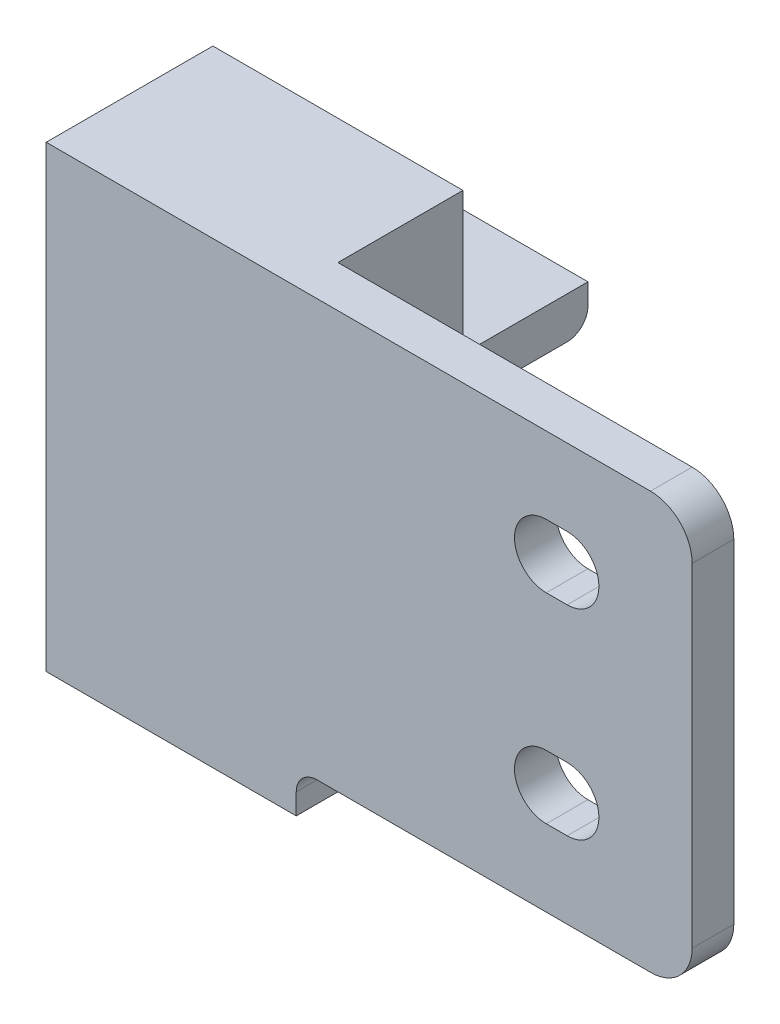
ISO-10303-21;
HEADER;
FILE_DESCRIPTION(('STEP AP214'),'2;1');
FILE_NAME('part.step','',(''),(''),'','','');
FILE_SCHEMA(('AUTOMOTIVE_DESIGN { 1 0 10303 214 1 1 1 1 }'));
ENDSEC;
DATA;
#1=APPLICATION_CONTEXT('core data for automotive mechanical design processes');
#2=APPLICATION_PROTOCOL_DEFINITION('international standard','automotive_design',2000,#1);
#3=PRODUCT_CONTEXT('',#1,'mechanical');
#4=PRODUCT('Part','Part','',(#3));
#5=PRODUCT_RELATED_PRODUCT_CATEGORY('part','',(#4));
#6=PRODUCT_DEFINITION_FORMATION('','',#4);
#7=PRODUCT_DEFINITION_CONTEXT('part definition',#1,'design');
#8=PRODUCT_DEFINITION('design','',#6,#7);
#9=PRODUCT_DEFINITION_SHAPE('','',#8);
#10=(LENGTH_UNIT() NAMED_UNIT(*) SI_UNIT(.MILLI.,.METRE.));
#11=(NAMED_UNIT(*) PLANE_ANGLE_UNIT() SI_UNIT($,.RADIAN.));
#12=(NAMED_UNIT(*) SI_UNIT($,.STERADIAN.) SOLID_ANGLE_UNIT());
#13=UNCERTAINTY_MEASURE_WITH_UNIT(LENGTH_MEASURE(1.E-05),#10,'distance_accuracy_value','');
#14=(GEOMETRIC_REPRESENTATION_CONTEXT(3) GLOBAL_UNCERTAINTY_ASSIGNED_CONTEXT((#13)) GLOBAL_UNIT_ASSIGNED_CONTEXT((#10,
#11,#12)) REPRESENTATION_CONTEXT('',''));
#15=CARTESIAN_POINT('',(0.,0.,0.));
#16=DIRECTION('',(0.,0.,1.));
#17=DIRECTION('',(1.,0.,0.));
#18=AXIS2_PLACEMENT_3D('',#15,#16,#17);
#19=CARTESIAN_POINT('',(0.,0.,-6.));
#20=DIRECTION('',(0.,0.,1.));
#21=DIRECTION('',(1.,0.,0.));
#22=AXIS2_PLACEMENT_3D('',#19,#20,#21);
#23=PLANE('',#22);
#24=DIRECTION('',(0.,-1.,0.));
#25=VECTOR('',#24,1.);
#26=CARTESIAN_POINT('',(-30.5,10.,-6.));
#27=LINE('',#26,#25);
#28=CARTESIAN_POINT('',(-30.5,1.2,-6.));
#29=VERTEX_POINT('',#28);
#30=CARTESIAN_POINT('',(-30.5,-10.,-6.));
#31=VERTEX_POINT('',#30);
#32=EDGE_CURVE('E263',#29,#31,#27,.T.);
#33=ORIENTED_EDGE('',*,*,#32,.F.);
#34=DIRECTION('',(1.,0.,0.));
#35=VECTOR('',#34,1.);
#36=CARTESIAN_POINT('',(0.,1.2,-6.));
#37=LINE('',#36,#35);
#38=CARTESIAN_POINT('',(-18.5,1.2,-6.));
#39=VERTEX_POINT('',#38);
#40=EDGE_CURVE('E379',#29,#39,#37,.T.);
#41=ORIENTED_EDGE('',*,*,#40,.T.);
#42=DIRECTION('',(0.,1.,0.));
#43=VECTOR('',#42,1.);
#44=CARTESIAN_POINT('',(-18.5,10.,-6.));
#45=LINE('',#44,#43);
#46=CARTESIAN_POINT('',(-18.5,-10.,-6.));
#47=VERTEX_POINT('',#46);
#48=EDGE_CURVE('E267',#47,#39,#45,.T.);
#49=ORIENTED_EDGE('',*,*,#48,.F.);
#50=DIRECTION('',(1.,0.,0.));
#51=VECTOR('',#50,1.);
#52=CARTESIAN_POINT('',(-30.5,-10.,-6.));
#53=LINE('',#52,#51);
#54=EDGE_CURVE('E262',#31,#47,#53,.T.);
#55=ORIENTED_EDGE('',*,*,#54,.F.);
#56=EDGE_LOOP('',(#33,#41,#49,#55));
#57=FACE_BOUND('',#56,.T.);
#58=ADVANCED_FACE('F33',(#57),#23,.F.);
#59=CARTESIAN_POINT('',(0.,0.,0.));
#60=DIRECTION('',(0.,0.,-1.));
#61=DIRECTION('',(-1.,0.,0.));
#62=AXIS2_PLACEMENT_3D('',#59,#60,#61);
#63=PLANE('',#62);
#64=DIRECTION('',(-1.,0.,0.));
#65=VECTOR('',#64,1.);
#66=CARTESIAN_POINT('',(-6.5,6.325,0.));
#67=LINE('',#66,#65);
#68=CARTESIAN_POINT('',(-5.5,6.325,0.));
#69=VERTEX_POINT('',#68);
#70=CARTESIAN_POINT('',(-6.5,6.325,0.));
#71=VERTEX_POINT('',#70);
#72=EDGE_CURVE('E312',#69,#71,#67,.T.);
#73=ORIENTED_EDGE('',*,*,#72,.T.);
#74=CARTESIAN_POINT('',(-6.5,4.8,0.));
#75=DIRECTION('',(0.,0.,1.));
#76=DIRECTION('',(1.,0.,0.));
#77=AXIS2_PLACEMENT_3D('',#74,#75,#76);
#78=CIRCLE('',#77,1.525);
#79=CARTESIAN_POINT('',(-6.5,3.275,0.));
#80=VERTEX_POINT('',#79);
#81=EDGE_CURVE('E308',#71,#80,#78,.T.);
#82=ORIENTED_EDGE('',*,*,#81,.T.);
#83=DIRECTION('',(1.,0.,0.));
#84=VECTOR('',#83,1.);
#85=CARTESIAN_POINT('',(-6.5,3.275,0.));
#86=LINE('',#85,#84);
#87=CARTESIAN_POINT('',(-5.5,3.275,0.));
#88=VERTEX_POINT('',#87);
#89=EDGE_CURVE('E322',#80,#88,#86,.T.);
#90=ORIENTED_EDGE('',*,*,#89,.T.);
#91=CARTESIAN_POINT('',(-5.5,4.8,0.));
#92=DIRECTION('',(0.,0.,1.));
#93=DIRECTION('',(1.,0.,0.));
#94=AXIS2_PLACEMENT_3D('',#91,#92,#93);
#95=CIRCLE('',#94,1.525);
#96=EDGE_CURVE('E325',#88,#69,#95,.T.);
#97=ORIENTED_EDGE('',*,*,#96,.T.);
#98=EDGE_LOOP('',(#73,#82,#90,#97));
#99=FACE_BOUND('',#98,.T.);
#100=DIRECTION('',(-1.,0.,0.));
#101=VECTOR('',#100,1.);
#102=CARTESIAN_POINT('',(-6.49999999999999,-3.275,0.));
#103=LINE('',#102,#101);
#104=CARTESIAN_POINT('',(-5.5,-3.275,0.));
#105=VERTEX_POINT('',#104);
#106=CARTESIAN_POINT('',(-6.49999999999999,-3.275,0.));
#107=VERTEX_POINT('',#106);
#108=EDGE_CURVE('E281',#105,#107,#103,.T.);
#109=ORIENTED_EDGE('',*,*,#108,.T.);
#110=CARTESIAN_POINT('',(-6.49999999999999,-4.8,0.));
#111=DIRECTION('',(0.,0.,1.));
#112=DIRECTION('',(1.,0.,0.));
#113=AXIS2_PLACEMENT_3D('',#110,#111,#112);
#114=CIRCLE('',#113,1.525);
#115=CARTESIAN_POINT('',(-6.49999999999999,-6.325,0.));
#116=VERTEX_POINT('',#115);
#117=EDGE_CURVE('E277',#107,#116,#114,.T.);
#118=ORIENTED_EDGE('',*,*,#117,.T.);
#119=DIRECTION('',(1.,0.,0.));
#120=VECTOR('',#119,1.);
#121=CARTESIAN_POINT('',(-6.49999999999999,-6.325,0.));
#122=LINE('',#121,#120);
#123=CARTESIAN_POINT('',(-5.5,-6.325,0.));
#124=VERTEX_POINT('',#123);
#125=EDGE_CURVE('E291',#116,#124,#122,.T.);
#126=ORIENTED_EDGE('',*,*,#125,.T.);
#127=CARTESIAN_POINT('',(-5.49999999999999,-4.8,0.));
#128=DIRECTION('',(0.,0.,1.));
#129=DIRECTION('',(1.,0.,0.));
#130=AXIS2_PLACEMENT_3D('',#127,#128,#129);
#131=CIRCLE('',#130,1.525);
#132=EDGE_CURVE('E294',#124,#105,#131,.T.);
#133=ORIENTED_EDGE('',*,*,#132,.T.);
#134=EDGE_LOOP('',(#109,#118,#126,#133));
#135=FACE_BOUND('',#134,.T.);
#136=DIRECTION('',(0.,1.,0.));
#137=VECTOR('',#136,1.);
#138=CARTESIAN_POINT('',(0.499999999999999,10.,0.));
#139=LINE('',#138,#137);
#140=CARTESIAN_POINT('',(0.500000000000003,-8.,0.));
#141=VERTEX_POINT('',#140);
#142=CARTESIAN_POINT('',(0.5,8.,0.));
#143=VERTEX_POINT('',#142);
#144=EDGE_CURVE('E339',#141,#143,#139,.T.);
#145=ORIENTED_EDGE('',*,*,#144,.F.);
#146=CARTESIAN_POINT('',(-1.5,-8.,0.));
#147=DIRECTION('',(0.,0.,-1.));
#148=DIRECTION('',(-1.,0.,0.));
#149=AXIS2_PLACEMENT_3D('',#146,#147,#148);
#150=CIRCLE('',#149,2.);
#151=CARTESIAN_POINT('',(-1.5,-10.,0.));
#152=VERTEX_POINT('',#151);
#153=EDGE_CURVE('E365',#141,#152,#150,.T.);
#154=ORIENTED_EDGE('',*,*,#153,.T.);
#155=DIRECTION('',(1.,0.,0.));
#156=VECTOR('',#155,1.);
#157=CARTESIAN_POINT('',(0.500000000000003,-10.,0.));
#158=LINE('',#157,#156);
#159=CARTESIAN_POINT('',(-17.5,-10.,0.));
#160=VERTEX_POINT('',#159);
#161=EDGE_CURVE('E344',#160,#152,#158,.T.);
#162=ORIENTED_EDGE('',*,*,#161,.F.);
#163=CARTESIAN_POINT('',(-17.5,-11.,0.));
#164=DIRECTION('',(0.,0.,-1.));
#165=DIRECTION('',(-1.,0.,0.));
#166=AXIS2_PLACEMENT_3D('',#163,#164,#165);
#167=CIRCLE('',#166,1.);
#168=CARTESIAN_POINT('',(-18.5,-11.,0.));
#169=VERTEX_POINT('',#168);
#170=EDGE_CURVE('E11',#160,#169,#167,.F.);
#171=ORIENTED_EDGE('',*,*,#170,.T.);
#172=DIRECTION('',(0.,1.,0.));
#173=VECTOR('',#172,1.);
#174=CARTESIAN_POINT('',(-18.5,10.,0.));
#175=LINE('',#174,#173);
#176=CARTESIAN_POINT('',(-18.5,10.,0.));
#177=VERTEX_POINT('',#176);
#178=EDGE_CURVE('E252',#169,#177,#175,.T.);
#179=ORIENTED_EDGE('',*,*,#178,.T.);
#180=DIRECTION('',(-1.,0.,0.));
#181=VECTOR('',#180,1.);
#182=CARTESIAN_POINT('',(-30.5,10.,0.));
#183=LINE('',#182,#181);
#184=CARTESIAN_POINT('',(-1.5,10.,0.));
#185=VERTEX_POINT('',#184);
#186=EDGE_CURVE('E353',#185,#177,#183,.T.);
#187=ORIENTED_EDGE('',*,*,#186,.F.);
#188=CARTESIAN_POINT('',(-1.5,8.,0.));
#189=DIRECTION('',(0.,0.,-1.));
#190=DIRECTION('',(-1.,0.,0.));
#191=AXIS2_PLACEMENT_3D('',#188,#189,#190);
#192=CIRCLE('',#191,2.);
#193=EDGE_CURVE('E363',#185,#143,#192,.T.);
#194=ORIENTED_EDGE('',*,*,#193,.T.);
#195=EDGE_LOOP('',(#145,#154,#162,#171,#179,#187,#194));
#196=FACE_BOUND('',#195,.T.);
#197=ADVANCED_FACE('F455',(#99,#135,#196),#63,.T.);
#198=CARTESIAN_POINT('',(0.,0.,2.));
#199=DIRECTION('',(0.,0.,-1.));
#200=DIRECTION('',(-1.,0.,0.));
#201=AXIS2_PLACEMENT_3D('',#198,#199,#200);
#202=PLANE('',#201);
#203=DIRECTION('',(0.,-1.,0.));
#204=VECTOR('',#203,1.);
#205=CARTESIAN_POINT('',(-30.5,10.,2.));
#206=LINE('',#205,#204);
#207=CARTESIAN_POINT('',(-30.5,10.,2.));
#208=VERTEX_POINT('',#207);
#209=CARTESIAN_POINT('',(-30.5,-12.,2.));
#210=VERTEX_POINT('',#209);
#211=EDGE_CURVE('E346',#208,#210,#206,.T.);
#212=ORIENTED_EDGE('',*,*,#211,.T.);
#213=DIRECTION('',(1.,0.,0.));
#214=VECTOR('',#213,1.);
#215=CARTESIAN_POINT('',(-30.5,-12.,2.));
#216=LINE('',#215,#214);
#217=CARTESIAN_POINT('',(-18.5,-12.,2.));
#218=VERTEX_POINT('',#217);
#219=EDGE_CURVE('E234',#210,#218,#216,.T.);
#220=ORIENTED_EDGE('',*,*,#219,.T.);
#221=DIRECTION('',(0.,1.,0.));
#222=VECTOR('',#221,1.);
#223=CARTESIAN_POINT('',(-18.5,-10.,2.));
#224=LINE('',#223,#222);
#225=CARTESIAN_POINT('',(-18.5,-11.,2.));
#226=VERTEX_POINT('',#225);
#227=EDGE_CURVE('E240',#218,#226,#224,.T.);
#228=ORIENTED_EDGE('',*,*,#227,.T.);
#229=CARTESIAN_POINT('',(-17.5,-11.,2.));
#230=DIRECTION('',(0.,0.,-1.));
#231=DIRECTION('',(-1.,0.,0.));
#232=AXIS2_PLACEMENT_3D('',#229,#230,#231);
#233=CIRCLE('',#232,1.);
#234=CARTESIAN_POINT('',(-17.5,-10.,2.));
#235=VERTEX_POINT('',#234);
#236=EDGE_CURVE('E41',#226,#235,#233,.T.);
#237=ORIENTED_EDGE('',*,*,#236,.T.);
#238=DIRECTION('',(1.,0.,0.));
#239=VECTOR('',#238,1.);
#240=CARTESIAN_POINT('',(0.500000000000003,-10.,2.));
#241=LINE('',#240,#239);
#242=CARTESIAN_POINT('',(-1.5,-10.,2.));
#243=VERTEX_POINT('',#242);
#244=EDGE_CURVE('E348',#235,#243,#241,.T.);
#245=ORIENTED_EDGE('',*,*,#244,.T.);
#246=CARTESIAN_POINT('',(-1.5,-8.,2.));
#247=DIRECTION('',(0.,0.,-1.));
#248=DIRECTION('',(-1.,0.,0.));
#249=AXIS2_PLACEMENT_3D('',#246,#247,#248);
#250=CIRCLE('',#249,2.);
#251=CARTESIAN_POINT('',(0.500000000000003,-8.,2.));
#252=VERTEX_POINT('',#251);
#253=EDGE_CURVE('E373',#243,#252,#250,.F.);
#254=ORIENTED_EDGE('',*,*,#253,.T.);
#255=DIRECTION('',(0.,1.,0.));
#256=VECTOR('',#255,1.);
#257=CARTESIAN_POINT('',(0.499999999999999,10.,2.));
#258=LINE('',#257,#256);
#259=CARTESIAN_POINT('',(0.5,8.,2.));
#260=VERTEX_POINT('',#259);
#261=EDGE_CURVE('E340',#252,#260,#258,.T.);
#262=ORIENTED_EDGE('',*,*,#261,.T.);
#263=CARTESIAN_POINT('',(-1.5,8.,2.));
#264=DIRECTION('',(0.,0.,-1.));
#265=DIRECTION('',(-1.,0.,0.));
#266=AXIS2_PLACEMENT_3D('',#263,#264,#265);
#267=CIRCLE('',#266,2.);
#268=CARTESIAN_POINT('',(-1.5,10.,2.));
#269=VERTEX_POINT('',#268);
#270=EDGE_CURVE('E371',#260,#269,#267,.F.);
#271=ORIENTED_EDGE('',*,*,#270,.T.);
#272=DIRECTION('',(-1.,0.,0.));
#273=VECTOR('',#272,1.);
#274=CARTESIAN_POINT('',(-30.5,10.,2.));
#275=LINE('',#274,#273);
#276=EDGE_CURVE('E343',#269,#208,#275,.T.);
#277=ORIENTED_EDGE('',*,*,#276,.T.);
#278=EDGE_LOOP('',(#212,#220,#228,#237,#245,#254,#262,#271,#277));
#279=FACE_BOUND('',#278,.T.);
#280=CARTESIAN_POINT('',(-6.5,4.8,2.));
#281=DIRECTION('',(0.,0.,1.));
#282=DIRECTION('',(1.,0.,0.));
#283=AXIS2_PLACEMENT_3D('',#280,#281,#282);
#284=CIRCLE('',#283,1.525);
#285=CARTESIAN_POINT('',(-6.5,6.325,2.));
#286=VERTEX_POINT('',#285);
#287=CARTESIAN_POINT('',(-6.5,3.275,2.));
#288=VERTEX_POINT('',#287);
#289=EDGE_CURVE('E309',#286,#288,#284,.T.);
#290=ORIENTED_EDGE('',*,*,#289,.F.);
#291=DIRECTION('',(-1.,0.,0.));
#292=VECTOR('',#291,1.);
#293=CARTESIAN_POINT('',(-6.5,6.325,2.));
#294=LINE('',#293,#292);
#295=CARTESIAN_POINT('',(-5.5,6.325,2.));
#296=VERTEX_POINT('',#295);
#297=EDGE_CURVE('E317',#296,#286,#294,.T.);
#298=ORIENTED_EDGE('',*,*,#297,.F.);
#299=CARTESIAN_POINT('',(-5.5,4.8,2.));
#300=DIRECTION('',(0.,0.,1.));
#301=DIRECTION('',(1.,0.,0.));
#302=AXIS2_PLACEMENT_3D('',#299,#300,#301);
#303=CIRCLE('',#302,1.525);
#304=CARTESIAN_POINT('',(-5.5,3.275,2.));
#305=VERTEX_POINT('',#304);
#306=EDGE_CURVE('E314',#305,#296,#303,.T.);
#307=ORIENTED_EDGE('',*,*,#306,.F.);
#308=DIRECTION('',(1.,0.,0.));
#309=VECTOR('',#308,1.);
#310=CARTESIAN_POINT('',(-6.5,3.275,2.));
#311=LINE('',#310,#309);
#312=EDGE_CURVE('E311',#288,#305,#311,.T.);
#313=ORIENTED_EDGE('',*,*,#312,.F.);
#314=EDGE_LOOP('',(#290,#298,#307,#313));
#315=FACE_BOUND('',#314,.T.);
#316=CARTESIAN_POINT('',(-6.49999999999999,-4.8,2.));
#317=DIRECTION('',(0.,0.,1.));
#318=DIRECTION('',(1.,0.,0.));
#319=AXIS2_PLACEMENT_3D('',#316,#317,#318);
#320=CIRCLE('',#319,1.525);
#321=CARTESIAN_POINT('',(-6.49999999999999,-3.275,2.));
#322=VERTEX_POINT('',#321);
#323=CARTESIAN_POINT('',(-6.49999999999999,-6.325,2.));
#324=VERTEX_POINT('',#323);
#325=EDGE_CURVE('E278',#322,#324,#320,.T.);
#326=ORIENTED_EDGE('',*,*,#325,.F.);
#327=DIRECTION('',(-1.,0.,0.));
#328=VECTOR('',#327,1.);
#329=CARTESIAN_POINT('',(-6.49999999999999,-3.275,2.));
#330=LINE('',#329,#328);
#331=CARTESIAN_POINT('',(-5.5,-3.275,2.));
#332=VERTEX_POINT('',#331);
#333=EDGE_CURVE('E286',#332,#322,#330,.T.);
#334=ORIENTED_EDGE('',*,*,#333,.F.);
#335=CARTESIAN_POINT('',(-5.49999999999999,-4.8,2.));
#336=DIRECTION('',(0.,0.,1.));
#337=DIRECTION('',(1.,0.,0.));
#338=AXIS2_PLACEMENT_3D('',#335,#336,#337);
#339=CIRCLE('',#338,1.525);
#340=CARTESIAN_POINT('',(-5.5,-6.325,2.));
#341=VERTEX_POINT('',#340);
#342=EDGE_CURVE('E283',#341,#332,#339,.T.);
#343=ORIENTED_EDGE('',*,*,#342,.F.);
#344=DIRECTION('',(1.,0.,0.));
#345=VECTOR('',#344,1.);
#346=CARTESIAN_POINT('',(-6.49999999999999,-6.325,2.));
#347=LINE('',#346,#345);
#348=EDGE_CURVE('E280',#324,#341,#347,.T.);
#349=ORIENTED_EDGE('',*,*,#348,.F.);
#350=EDGE_LOOP('',(#326,#334,#343,#349));
#351=FACE_BOUND('',#350,.T.);
#352=ADVANCED_FACE('F438',(#279,#315,#351),#202,.F.);
#353=CARTESIAN_POINT('',(0.499999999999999,10.,2.));
#354=DIRECTION('',(-1.,0.,0.));
#355=DIRECTION('',(0.,-1.,0.));
#356=AXIS2_PLACEMENT_3D('',#353,#354,#355);
#357=PLANE('',#356);
#358=ORIENTED_EDGE('',*,*,#261,.F.);
#359=DIRECTION('',(0.,0.,-1.));
#360=VECTOR('',#359,1.);
#361=CARTESIAN_POINT('',(0.500000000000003,-8.,2.));
#362=LINE('',#361,#360);
#363=EDGE_CURVE('E360',#252,#141,#362,.T.);
#364=ORIENTED_EDGE('',*,*,#363,.T.);
#365=ORIENTED_EDGE('',*,*,#144,.T.);
#366=DIRECTION('',(0.,0.,-1.));
#367=VECTOR('',#366,1.);
#368=CARTESIAN_POINT('',(0.5,8.,2.));
#369=LINE('',#368,#367);
#370=EDGE_CURVE('E358',#143,#260,#369,.F.);
#371=ORIENTED_EDGE('',*,*,#370,.T.);
#372=EDGE_LOOP('',(#358,#364,#365,#371));
#373=FACE_BOUND('',#372,.T.);
#374=ADVANCED_FACE('F516',(#373),#357,.F.);
#375=CARTESIAN_POINT('',(-30.5,10.,2.));
#376=DIRECTION('',(0.,-1.,0.));
#377=DIRECTION('',(1.,0.,0.));
#378=AXIS2_PLACEMENT_3D('',#375,#376,#377);
#379=PLANE('',#378);
#380=ORIENTED_EDGE('',*,*,#276,.F.);
#381=DIRECTION('',(0.,0.,-1.));
#382=VECTOR('',#381,1.);
#383=CARTESIAN_POINT('',(-1.5,10.,2.));
#384=LINE('',#383,#382);
#385=EDGE_CURVE('E375',#269,#185,#384,.T.);
#386=ORIENTED_EDGE('',*,*,#385,.T.);
#387=ORIENTED_EDGE('',*,*,#186,.T.);
#388=DIRECTION('',(0.,0.,1.));
#389=VECTOR('',#388,1.);
#390=CARTESIAN_POINT('',(-18.5,10.,-6.));
#391=LINE('',#390,#389);
#392=CARTESIAN_POINT('',(-18.5,10.,-6.));
#393=VERTEX_POINT('',#392);
#394=EDGE_CURVE('E273',#393,#177,#391,.T.);
#395=ORIENTED_EDGE('',*,*,#394,.F.);
#396=DIRECTION('',(-1.,0.,0.));
#397=VECTOR('',#396,1.);
#398=CARTESIAN_POINT('',(-20.5,10.,-6.));
#399=LINE('',#398,#397);
#400=CARTESIAN_POINT('',(-30.5,10.,-6.));
#401=VERTEX_POINT('',#400);
#402=EDGE_CURVE('E270',#393,#401,#399,.T.);
#403=ORIENTED_EDGE('',*,*,#402,.T.);
#404=DIRECTION('',(0.,0.,-1.));
#405=VECTOR('',#404,1.);
#406=CARTESIAN_POINT('',(-30.5,10.,2.));
#407=LINE('',#406,#405);
#408=EDGE_CURVE('E350',#208,#401,#407,.T.);
#409=ORIENTED_EDGE('',*,*,#408,.F.);
#410=EDGE_LOOP('',(#380,#386,#387,#395,#403,#409));
#411=FACE_BOUND('',#410,.T.);
#412=ADVANCED_FACE('F444',(#411),#379,.F.);
#413=CARTESIAN_POINT('',(-30.5,10.,2.));
#414=DIRECTION('',(1.,0.,0.));
#415=DIRECTION('',(0.,1.,0.));
#416=AXIS2_PLACEMENT_3D('',#413,#414,#415);
#417=PLANE('',#416);
#418=DIRECTION('',(0.,0.,1.));
#419=VECTOR('',#418,1.);
#420=CARTESIAN_POINT('',(-30.5,-10.,-12.));
#421=LINE('',#420,#419);
#422=CARTESIAN_POINT('',(-30.5,-10.,-11.));
#423=VERTEX_POINT('',#422);
#424=EDGE_CURVE('E250',#423,#31,#421,.T.);
#425=ORIENTED_EDGE('',*,*,#424,.F.);
#426=CARTESIAN_POINT('',(-30.5,-11.,-11.));
#427=DIRECTION('',(1.,0.,0.));
#428=DIRECTION('',(0.,1.,0.));
#429=AXIS2_PLACEMENT_3D('',#426,#427,#428);
#430=CIRCLE('',#429,1.);
#431=CARTESIAN_POINT('',(-30.5,-11.,-12.));
#432=VERTEX_POINT('',#431);
#433=EDGE_CURVE('E387',#423,#432,#430,.F.);
#434=ORIENTED_EDGE('',*,*,#433,.T.);
#435=DIRECTION('',(0.,-1.,0.));
#436=VECTOR('',#435,1.);
#437=CARTESIAN_POINT('',(-30.5,-10.,-12.));
#438=LINE('',#437,#436);
#439=CARTESIAN_POINT('',(-30.5,-12.,-12.));
#440=VERTEX_POINT('',#439);
#441=EDGE_CURVE('E242',#432,#440,#438,.T.);
#442=ORIENTED_EDGE('',*,*,#441,.T.);
#443=DIRECTION('',(0.,0.,1.));
#444=VECTOR('',#443,1.);
#445=CARTESIAN_POINT('',(-30.5,-12.,-12.));
#446=LINE('',#445,#444);
#447=EDGE_CURVE('E249',#440,#210,#446,.T.);
#448=ORIENTED_EDGE('',*,*,#447,.T.);
#449=ORIENTED_EDGE('',*,*,#211,.F.);
#450=ORIENTED_EDGE('',*,*,#408,.T.);
#451=CARTESIAN_POINT('',(-30.5,3.2,-6.));
#452=VERTEX_POINT('',#451);
#453=EDGE_CURVE('E259',#401,#452,#27,.T.);
#454=ORIENTED_EDGE('',*,*,#453,.T.);
#455=DIRECTION('',(0.,0.,1.));
#456=VECTOR('',#455,1.);
#457=CARTESIAN_POINT('',(-30.5,3.2,-12.));
#458=LINE('',#457,#456);
#459=CARTESIAN_POINT('',(-30.5,3.2,-12.));
#460=VERTEX_POINT('',#459);
#461=EDGE_CURVE('E223',#460,#452,#458,.T.);
#462=ORIENTED_EDGE('',*,*,#461,.F.);
#463=DIRECTION('',(0.,-1.,0.));
#464=VECTOR('',#463,1.);
#465=CARTESIAN_POINT('',(-30.5,1.2,-12.));
#466=LINE('',#465,#464);
#467=CARTESIAN_POINT('',(-30.5,2.2,-12.));
#468=VERTEX_POINT('',#467);
#469=EDGE_CURVE('E224',#460,#468,#466,.T.);
#470=ORIENTED_EDGE('',*,*,#469,.T.);
#471=CARTESIAN_POINT('',(-30.5,2.2,-11.));
#472=DIRECTION('',(1.,0.,0.));
#473=DIRECTION('',(0.,1.,0.));
#474=AXIS2_PLACEMENT_3D('',#471,#472,#473);
#475=CIRCLE('',#474,1.);
#476=CARTESIAN_POINT('',(-30.5,1.2,-11.));
#477=VERTEX_POINT('',#476);
#478=EDGE_CURVE('E385',#468,#477,#475,.F.);
#479=ORIENTED_EDGE('',*,*,#478,.T.);
#480=DIRECTION('',(0.,0.,1.));
#481=VECTOR('',#480,1.);
#482=CARTESIAN_POINT('',(-30.5,1.2,-12.));
#483=LINE('',#482,#481);
#484=EDGE_CURVE('E235',#477,#29,#483,.T.);
#485=ORIENTED_EDGE('',*,*,#484,.T.);
#486=ORIENTED_EDGE('',*,*,#32,.T.);
#487=EDGE_LOOP('',(#425,#434,#442,#448,#449,#450,#454,#462,#470,#479,#485,#486));
#488=FACE_BOUND('',#487,.T.);
#489=ADVANCED_FACE('F406',(#488),#417,.F.);
#490=CARTESIAN_POINT('',(0.500000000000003,-10.,2.));
#491=DIRECTION('',(0.,1.,0.));
#492=DIRECTION('',(0.,0.,1.));
#493=AXIS2_PLACEMENT_3D('',#490,#491,#492);
#494=PLANE('',#493);
#495=ORIENTED_EDGE('',*,*,#244,.F.);
#496=DIRECTION('',(0.,0.,1.));
#497=VECTOR('',#496,1.);
#498=CARTESIAN_POINT('',(-17.5,-10.,2.));
#499=LINE('',#498,#497);
#500=EDGE_CURVE('E48',#235,#160,#499,.F.);
#501=ORIENTED_EDGE('',*,*,#500,.T.);
#502=ORIENTED_EDGE('',*,*,#161,.T.);
#503=DIRECTION('',(0.,0.,-1.));
#504=VECTOR('',#503,1.);
#505=CARTESIAN_POINT('',(-1.5,-10.,2.));
#506=LINE('',#505,#504);
#507=EDGE_CURVE('E368',#152,#243,#506,.F.);
#508=ORIENTED_EDGE('',*,*,#507,.T.);
#509=EDGE_LOOP('',(#495,#501,#502,#508));
#510=FACE_BOUND('',#509,.T.);
#511=ADVANCED_FACE('F513',(#510),#494,.F.);
#512=CARTESIAN_POINT('',(-6.5,4.8,2.));
#513=DIRECTION('',(0.,0.,-1.));
#514=DIRECTION('',(-1.,0.,0.));
#515=AXIS2_PLACEMENT_3D('',#512,#513,#514);
#516=CYLINDRICAL_SURFACE('',#515,1.525);
#517=ORIENTED_EDGE('',*,*,#81,.F.);
#518=DIRECTION('',(0.,0.,-1.));
#519=VECTOR('',#518,1.);
#520=CARTESIAN_POINT('',(-6.5,6.325,2.));
#521=LINE('',#520,#519);
#522=EDGE_CURVE('E319',#286,#71,#521,.T.);
#523=ORIENTED_EDGE('',*,*,#522,.F.);
#524=ORIENTED_EDGE('',*,*,#289,.T.);
#525=DIRECTION('',(0.,0.,-1.));
#526=VECTOR('',#525,1.);
#527=CARTESIAN_POINT('',(-6.5,3.275,2.));
#528=LINE('',#527,#526);
#529=EDGE_CURVE('E336',#288,#80,#528,.T.);
#530=ORIENTED_EDGE('',*,*,#529,.T.);
#531=EDGE_LOOP('',(#517,#523,#524,#530));
#532=FACE_BOUND('',#531,.T.);
#533=ADVANCED_FACE('F509',(#532),#516,.F.);
#534=CARTESIAN_POINT('',(-6.5,3.275,2.));
#535=DIRECTION('',(0.,1.,0.));
#536=DIRECTION('',(0.,0.,1.));
#537=AXIS2_PLACEMENT_3D('',#534,#535,#536);
#538=PLANE('',#537);
#539=ORIENTED_EDGE('',*,*,#89,.F.);
#540=ORIENTED_EDGE('',*,*,#529,.F.);
#541=ORIENTED_EDGE('',*,*,#312,.T.);
#542=DIRECTION('',(0.,0.,-1.));
#543=VECTOR('',#542,1.);
#544=CARTESIAN_POINT('',(-5.5,3.275,2.));
#545=LINE('',#544,#543);
#546=EDGE_CURVE('E334',#305,#88,#545,.T.);
#547=ORIENTED_EDGE('',*,*,#546,.T.);
#548=EDGE_LOOP('',(#539,#540,#541,#547));
#549=FACE_BOUND('',#548,.T.);
#550=ADVANCED_FACE('F505',(#549),#538,.T.);
#551=CARTESIAN_POINT('',(-5.5,4.8,2.));
#552=DIRECTION('',(0.,0.,-1.));
#553=DIRECTION('',(-1.,0.,0.));
#554=AXIS2_PLACEMENT_3D('',#551,#552,#553);
#555=CYLINDRICAL_SURFACE('',#554,1.525);
#556=ORIENTED_EDGE('',*,*,#96,.F.);
#557=ORIENTED_EDGE('',*,*,#546,.F.);
#558=ORIENTED_EDGE('',*,*,#306,.T.);
#559=DIRECTION('',(0.,0.,-1.));
#560=VECTOR('',#559,1.);
#561=CARTESIAN_POINT('',(-5.5,6.325,2.));
#562=LINE('',#561,#560);
#563=EDGE_CURVE('E332',#296,#69,#562,.T.);
#564=ORIENTED_EDGE('',*,*,#563,.T.);
#565=EDGE_LOOP('',(#556,#557,#558,#564));
#566=FACE_BOUND('',#565,.T.);
#567=ADVANCED_FACE('F501',(#566),#555,.F.);
#568=CARTESIAN_POINT('',(-6.5,6.325,2.));
#569=DIRECTION('',(0.,-1.,0.));
#570=DIRECTION('',(0.,0.,-1.));
#571=AXIS2_PLACEMENT_3D('',#568,#569,#570);
#572=PLANE('',#571);
#573=ORIENTED_EDGE('',*,*,#72,.F.);
#574=ORIENTED_EDGE('',*,*,#563,.F.);
#575=ORIENTED_EDGE('',*,*,#297,.T.);
#576=ORIENTED_EDGE('',*,*,#522,.T.);
#577=EDGE_LOOP('',(#573,#574,#575,#576));
#578=FACE_BOUND('',#577,.T.);
#579=ADVANCED_FACE('F497',(#578),#572,.T.);
#580=CARTESIAN_POINT('',(-6.49999999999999,-4.8,2.));
#581=DIRECTION('',(0.,0.,-1.));
#582=DIRECTION('',(-1.,0.,0.));
#583=AXIS2_PLACEMENT_3D('',#580,#581,#582);
#584=CYLINDRICAL_SURFACE('',#583,1.525);
#585=ORIENTED_EDGE('',*,*,#117,.F.);
#586=DIRECTION('',(0.,0.,-1.));
#587=VECTOR('',#586,1.);
#588=CARTESIAN_POINT('',(-6.49999999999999,-3.275,2.));
#589=LINE('',#588,#587);
#590=EDGE_CURVE('E288',#322,#107,#589,.T.);
#591=ORIENTED_EDGE('',*,*,#590,.F.);
#592=ORIENTED_EDGE('',*,*,#325,.T.);
#593=DIRECTION('',(0.,0.,-1.));
#594=VECTOR('',#593,1.);
#595=CARTESIAN_POINT('',(-6.49999999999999,-6.325,2.));
#596=LINE('',#595,#594);
#597=EDGE_CURVE('E305',#324,#116,#596,.T.);
#598=ORIENTED_EDGE('',*,*,#597,.T.);
#599=EDGE_LOOP('',(#585,#591,#592,#598));
#600=FACE_BOUND('',#599,.T.);
#601=ADVANCED_FACE('F493',(#600),#584,.F.);
#602=CARTESIAN_POINT('',(-6.49999999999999,-6.325,2.));
#603=DIRECTION('',(0.,1.,0.));
#604=DIRECTION('',(0.,0.,1.));
#605=AXIS2_PLACEMENT_3D('',#602,#603,#604);
#606=PLANE('',#605);
#607=ORIENTED_EDGE('',*,*,#125,.F.);
#608=ORIENTED_EDGE('',*,*,#597,.F.);
#609=ORIENTED_EDGE('',*,*,#348,.T.);
#610=DIRECTION('',(0.,0.,-1.));
#611=VECTOR('',#610,1.);
#612=CARTESIAN_POINT('',(-5.5,-6.325,2.));
#613=LINE('',#612,#611);
#614=EDGE_CURVE('E303',#341,#124,#613,.T.);
#615=ORIENTED_EDGE('',*,*,#614,.T.);
#616=EDGE_LOOP('',(#607,#608,#609,#615));
#617=FACE_BOUND('',#616,.T.);
#618=ADVANCED_FACE('F489',(#617),#606,.T.);
#619=CARTESIAN_POINT('',(-5.49999999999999,-4.8,2.));
#620=DIRECTION('',(0.,0.,-1.));
#621=DIRECTION('',(-1.,0.,0.));
#622=AXIS2_PLACEMENT_3D('',#619,#620,#621);
#623=CYLINDRICAL_SURFACE('',#622,1.525);
#624=ORIENTED_EDGE('',*,*,#132,.F.);
#625=ORIENTED_EDGE('',*,*,#614,.F.);
#626=ORIENTED_EDGE('',*,*,#342,.T.);
#627=DIRECTION('',(0.,0.,-1.));
#628=VECTOR('',#627,1.);
#629=CARTESIAN_POINT('',(-5.5,-3.275,2.));
#630=LINE('',#629,#628);
#631=EDGE_CURVE('E301',#332,#105,#630,.T.);
#632=ORIENTED_EDGE('',*,*,#631,.T.);
#633=EDGE_LOOP('',(#624,#625,#626,#632));
#634=FACE_BOUND('',#633,.T.);
#635=ADVANCED_FACE('F483',(#634),#623,.F.);
#636=CARTESIAN_POINT('',(-6.49999999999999,-3.275,2.));
#637=DIRECTION('',(0.,-1.,0.));
#638=DIRECTION('',(0.,0.,-1.));
#639=AXIS2_PLACEMENT_3D('',#636,#637,#638);
#640=PLANE('',#639);
#641=ORIENTED_EDGE('',*,*,#108,.F.);
#642=ORIENTED_EDGE('',*,*,#631,.F.);
#643=ORIENTED_EDGE('',*,*,#333,.T.);
#644=ORIENTED_EDGE('',*,*,#590,.T.);
#645=EDGE_LOOP('',(#641,#642,#643,#644));
#646=FACE_BOUND('',#645,.T.);
#647=ADVANCED_FACE('F479',(#646),#640,.T.);
#648=CARTESIAN_POINT('',(-18.5,10.,-6.));
#649=DIRECTION('',(1.,0.,0.));
#650=DIRECTION('',(0.,0.,-1.));
#651=AXIS2_PLACEMENT_3D('',#648,#649,#650);
#652=PLANE('',#651);
#653=DIRECTION('',(0.,1.,0.));
#654=VECTOR('',#653,1.);
#655=CARTESIAN_POINT('',(-18.5,-10.,-12.));
#656=LINE('',#655,#654);
#657=CARTESIAN_POINT('',(-18.5,-12.,-12.));
#658=VERTEX_POINT('',#657);
#659=CARTESIAN_POINT('',(-18.5,-11.,-12.));
#660=VERTEX_POINT('',#659);
#661=EDGE_CURVE('E247',#658,#660,#656,.T.);
#662=ORIENTED_EDGE('',*,*,#661,.T.);
#663=CARTESIAN_POINT('',(-18.5,-11.,-11.));
#664=DIRECTION('',(1.,0.,0.));
#665=DIRECTION('',(0.,0.,-1.));
#666=AXIS2_PLACEMENT_3D('',#663,#664,#665);
#667=CIRCLE('',#666,1.);
#668=CARTESIAN_POINT('',(-18.5,-10.,-11.));
#669=VERTEX_POINT('',#668);
#670=EDGE_CURVE('E395',#660,#669,#667,.T.);
#671=ORIENTED_EDGE('',*,*,#670,.T.);
#672=DIRECTION('',(0.,0.,1.));
#673=VECTOR('',#672,1.);
#674=CARTESIAN_POINT('',(-18.5,-10.,-12.));
#675=LINE('',#674,#673);
#676=EDGE_CURVE('E253',#669,#47,#675,.T.);
#677=ORIENTED_EDGE('',*,*,#676,.T.);
#678=ORIENTED_EDGE('',*,*,#48,.T.);
#679=DIRECTION('',(0.,0.,1.));
#680=VECTOR('',#679,1.);
#681=CARTESIAN_POINT('',(-18.5,1.2,-12.));
#682=LINE('',#681,#680);
#683=CARTESIAN_POINT('',(-18.5,1.2,-11.));
#684=VERTEX_POINT('',#683);
#685=EDGE_CURVE('E232',#684,#39,#682,.T.);
#686=ORIENTED_EDGE('',*,*,#685,.F.);
#687=CARTESIAN_POINT('',(-18.5,2.2,-11.));
#688=DIRECTION('',(1.,0.,0.));
#689=DIRECTION('',(0.,0.,-1.));
#690=AXIS2_PLACEMENT_3D('',#687,#688,#689);
#691=CIRCLE('',#690,1.);
#692=CARTESIAN_POINT('',(-18.5,2.2,-12.));
#693=VERTEX_POINT('',#692);
#694=EDGE_CURVE('E212',#684,#693,#691,.T.);
#695=ORIENTED_EDGE('',*,*,#694,.T.);
#696=DIRECTION('',(0.,1.,0.));
#697=VECTOR('',#696,1.);
#698=CARTESIAN_POINT('',(-18.5,1.2,-12.));
#699=LINE('',#698,#697);
#700=CARTESIAN_POINT('',(-18.5,3.2,-12.));
#701=VERTEX_POINT('',#700);
#702=EDGE_CURVE('E205',#693,#701,#699,.T.);
#703=ORIENTED_EDGE('',*,*,#702,.T.);
#704=DIRECTION('',(0.,0.,1.));
#705=VECTOR('',#704,1.);
#706=CARTESIAN_POINT('',(-18.5,3.2,-12.));
#707=LINE('',#706,#705);
#708=CARTESIAN_POINT('',(-18.5,3.2,-6.));
#709=VERTEX_POINT('',#708);
#710=EDGE_CURVE('E209',#701,#709,#707,.T.);
#711=ORIENTED_EDGE('',*,*,#710,.T.);
#712=EDGE_CURVE('E266',#709,#393,#45,.T.);
#713=ORIENTED_EDGE('',*,*,#712,.T.);
#714=ORIENTED_EDGE('',*,*,#394,.T.);
#715=ORIENTED_EDGE('',*,*,#178,.F.);
#716=DIRECTION('',(0.,0.,1.));
#717=VECTOR('',#716,1.);
#718=CARTESIAN_POINT('',(-18.5,-11.,-6.));
#719=LINE('',#718,#717);
#720=EDGE_CURVE('E391',#169,#226,#719,.T.);
#721=ORIENTED_EDGE('',*,*,#720,.T.);
#722=ORIENTED_EDGE('',*,*,#227,.F.);
#723=DIRECTION('',(0.,0.,1.));
#724=VECTOR('',#723,1.);
#725=CARTESIAN_POINT('',(-18.5,-12.,-12.));
#726=LINE('',#725,#724);
#727=EDGE_CURVE('E255',#658,#218,#726,.T.);
#728=ORIENTED_EDGE('',*,*,#727,.F.);
#729=EDGE_LOOP('',(#662,#671,#677,#678,#686,#695,#703,#711,#713,#714,#715,#721,#722,#728));
#730=FACE_BOUND('',#729,.T.);
#731=ADVANCED_FACE('F208',(#730),#652,.T.);
#732=ORIENTED_EDGE('',*,*,#712,.F.);
#733=DIRECTION('',(-1.,0.,0.));
#734=VECTOR('',#733,1.);
#735=CARTESIAN_POINT('',(0.,3.2,-6.));
#736=LINE('',#735,#734);
#737=EDGE_CURVE('E222',#709,#452,#736,.T.);
#738=ORIENTED_EDGE('',*,*,#737,.T.);
#739=ORIENTED_EDGE('',*,*,#453,.F.);
#740=ORIENTED_EDGE('',*,*,#402,.F.);
#741=EDGE_LOOP('',(#732,#738,#739,#740));
#742=FACE_BOUND('',#741,.T.);
#743=ADVANCED_FACE('F449',(#742),#23,.F.);
#744=CARTESIAN_POINT('',(-1.5,-8.,2.));
#745=DIRECTION('',(0.,0.,-1.));
#746=DIRECTION('',(-1.,0.,0.));
#747=AXIS2_PLACEMENT_3D('',#744,#745,#746);
#748=CYLINDRICAL_SURFACE('',#747,2.);
#749=ORIENTED_EDGE('',*,*,#253,.F.);
#750=ORIENTED_EDGE('',*,*,#507,.F.);
#751=ORIENTED_EDGE('',*,*,#153,.F.);
#752=ORIENTED_EDGE('',*,*,#363,.F.);
#753=EDGE_LOOP('',(#749,#750,#751,#752));
#754=FACE_BOUND('',#753,.T.);
#755=ADVANCED_FACE('F471',(#754),#748,.T.);
#756=CARTESIAN_POINT('',(-1.5,8.,2.));
#757=DIRECTION('',(0.,0.,-1.));
#758=DIRECTION('',(-1.,0.,0.));
#759=AXIS2_PLACEMENT_3D('',#756,#757,#758);
#760=CYLINDRICAL_SURFACE('',#759,2.);
#761=ORIENTED_EDGE('',*,*,#270,.F.);
#762=ORIENTED_EDGE('',*,*,#370,.F.);
#763=ORIENTED_EDGE('',*,*,#193,.F.);
#764=ORIENTED_EDGE('',*,*,#385,.F.);
#765=EDGE_LOOP('',(#761,#762,#763,#764));
#766=FACE_BOUND('',#765,.T.);
#767=ADVANCED_FACE('F476',(#766),#760,.T.);
#768=CARTESIAN_POINT('',(-30.5,-10.,-12.));
#769=DIRECTION('',(0.,1.,0.));
#770=DIRECTION('',(0.,0.,1.));
#771=AXIS2_PLACEMENT_3D('',#768,#769,#770);
#772=PLANE('',#771);
#773=ORIENTED_EDGE('',*,*,#676,.F.);
#774=DIRECTION('',(-1.,0.,0.));
#775=VECTOR('',#774,1.);
#776=CARTESIAN_POINT('',(-30.5,-10.,-11.));
#777=LINE('',#776,#775);
#778=EDGE_CURVE('E382',#669,#423,#777,.T.);
#779=ORIENTED_EDGE('',*,*,#778,.T.);
#780=ORIENTED_EDGE('',*,*,#424,.T.);
#781=ORIENTED_EDGE('',*,*,#54,.T.);
#782=EDGE_LOOP('',(#773,#779,#780,#781));
#783=FACE_BOUND('',#782,.T.);
#784=ADVANCED_FACE('F419',(#783),#772,.T.);
#785=CARTESIAN_POINT('',(-30.5,-12.,-12.));
#786=DIRECTION('',(0.,-1.,0.));
#787=DIRECTION('',(0.,0.,-1.));
#788=AXIS2_PLACEMENT_3D('',#785,#786,#787);
#789=PLANE('',#788);
#790=ORIENTED_EDGE('',*,*,#727,.T.);
#791=ORIENTED_EDGE('',*,*,#219,.F.);
#792=ORIENTED_EDGE('',*,*,#447,.F.);
#793=DIRECTION('',(1.,0.,0.));
#794=VECTOR('',#793,1.);
#795=CARTESIAN_POINT('',(-30.5,-12.,-12.));
#796=LINE('',#795,#794);
#797=EDGE_CURVE('E244',#440,#658,#796,.T.);
#798=ORIENTED_EDGE('',*,*,#797,.T.);
#799=EDGE_LOOP('',(#790,#791,#792,#798));
#800=FACE_BOUND('',#799,.T.);
#801=ADVANCED_FACE('F434',(#800),#789,.T.);
#802=CARTESIAN_POINT('',(0.,0.,-12.));
#803=DIRECTION('',(0.,0.,1.));
#804=DIRECTION('',(1.,0.,0.));
#805=AXIS2_PLACEMENT_3D('',#802,#803,#804);
#806=PLANE('',#805);
#807=ORIENTED_EDGE('',*,*,#441,.F.);
#808=DIRECTION('',(-1.,0.,0.));
#809=VECTOR('',#808,1.);
#810=CARTESIAN_POINT('',(-18.5,-11.,-12.));
#811=LINE('',#810,#809);
#812=EDGE_CURVE('E389',#432,#660,#811,.F.);
#813=ORIENTED_EDGE('',*,*,#812,.T.);
#814=ORIENTED_EDGE('',*,*,#661,.F.);
#815=ORIENTED_EDGE('',*,*,#797,.F.);
#816=EDGE_LOOP('',(#807,#813,#814,#815));
#817=FACE_BOUND('',#816,.T.);
#818=ADVANCED_FACE('F428',(#817),#806,.F.);
#819=CARTESIAN_POINT('',(-30.5,1.2,-12.));
#820=DIRECTION('',(0.,-1.,0.));
#821=DIRECTION('',(0.,0.,-1.));
#822=AXIS2_PLACEMENT_3D('',#819,#820,#821);
#823=PLANE('',#822);
#824=ORIENTED_EDGE('',*,*,#484,.F.);
#825=DIRECTION('',(1.,0.,0.));
#826=VECTOR('',#825,1.);
#827=CARTESIAN_POINT('',(-30.5,1.2,-11.));
#828=LINE('',#827,#826);
#829=EDGE_CURVE('E397',#477,#684,#828,.T.);
#830=ORIENTED_EDGE('',*,*,#829,.T.);
#831=ORIENTED_EDGE('',*,*,#685,.T.);
#832=ORIENTED_EDGE('',*,*,#40,.F.);
#833=EDGE_LOOP('',(#824,#830,#831,#832));
#834=FACE_BOUND('',#833,.T.);
#835=ADVANCED_FACE('F411',(#834),#823,.T.);
#836=CARTESIAN_POINT('',(-30.5,3.2,-12.));
#837=DIRECTION('',(0.,1.,0.));
#838=DIRECTION('',(0.,0.,1.));
#839=AXIS2_PLACEMENT_3D('',#836,#837,#838);
#840=PLANE('',#839);
#841=ORIENTED_EDGE('',*,*,#737,.F.);
#842=ORIENTED_EDGE('',*,*,#710,.F.);
#843=DIRECTION('',(-1.,0.,0.));
#844=VECTOR('',#843,1.);
#845=CARTESIAN_POINT('',(-30.5,3.2,-12.));
#846=LINE('',#845,#844);
#847=EDGE_CURVE('E216',#701,#460,#846,.T.);
#848=ORIENTED_EDGE('',*,*,#847,.T.);
#849=ORIENTED_EDGE('',*,*,#461,.T.);
#850=EDGE_LOOP('',(#841,#842,#848,#849));
#851=FACE_BOUND('',#850,.T.);
#852=ADVANCED_FACE('F220',(#851),#840,.T.);
#853=CARTESIAN_POINT('',(0.,0.,-12.));
#854=DIRECTION('',(0.,0.,-1.));
#855=DIRECTION('',(-1.,0.,0.));
#856=AXIS2_PLACEMENT_3D('',#853,#854,#855);
#857=PLANE('',#856);
#858=ORIENTED_EDGE('',*,*,#702,.F.);
#859=DIRECTION('',(1.,0.,0.));
#860=VECTOR('',#859,1.);
#861=CARTESIAN_POINT('',(0.,2.2,-12.));
#862=LINE('',#861,#860);
#863=EDGE_CURVE('E400',#693,#468,#862,.F.);
#864=ORIENTED_EDGE('',*,*,#863,.T.);
#865=ORIENTED_EDGE('',*,*,#469,.F.);
#866=ORIENTED_EDGE('',*,*,#847,.F.);
#867=EDGE_LOOP('',(#858,#864,#865,#866));
#868=FACE_BOUND('',#867,.T.);
#869=ADVANCED_FACE('F227',(#868),#857,.T.);
#870=CARTESIAN_POINT('',(-30.5,-11.,-11.));
#871=DIRECTION('',(1.,0.,0.));
#872=DIRECTION('',(0.,0.,-1.));
#873=AXIS2_PLACEMENT_3D('',#870,#871,#872);
#874=CYLINDRICAL_SURFACE('',#873,1.);
#875=ORIENTED_EDGE('',*,*,#670,.F.);
#876=ORIENTED_EDGE('',*,*,#812,.F.);
#877=ORIENTED_EDGE('',*,*,#433,.F.);
#878=ORIENTED_EDGE('',*,*,#778,.F.);
#879=EDGE_LOOP('',(#875,#876,#877,#878));
#880=FACE_BOUND('',#879,.T.);
#881=ADVANCED_FACE('F431',(#880),#874,.T.);
#882=CARTESIAN_POINT('',(-30.5,2.2,-11.));
#883=DIRECTION('',(1.,0.,0.));
#884=DIRECTION('',(0.,0.,-1.));
#885=AXIS2_PLACEMENT_3D('',#882,#883,#884);
#886=CYLINDRICAL_SURFACE('',#885,1.);
#887=ORIENTED_EDGE('',*,*,#478,.F.);
#888=ORIENTED_EDGE('',*,*,#863,.F.);
#889=ORIENTED_EDGE('',*,*,#694,.F.);
#890=ORIENTED_EDGE('',*,*,#829,.F.);
#891=EDGE_LOOP('',(#887,#888,#889,#890));
#892=FACE_BOUND('',#891,.T.);
#893=ADVANCED_FACE('F409',(#892),#886,.T.);
#894=CARTESIAN_POINT('',(-17.5,-11.,-6.));
#895=DIRECTION('',(0.,0.,1.));
#896=DIRECTION('',(1.,0.,0.));
#897=AXIS2_PLACEMENT_3D('',#894,#895,#896);
#898=CYLINDRICAL_SURFACE('',#897,1.);
#899=ORIENTED_EDGE('',*,*,#170,.F.);
#900=ORIENTED_EDGE('',*,*,#500,.F.);
#901=ORIENTED_EDGE('',*,*,#236,.F.);
#902=ORIENTED_EDGE('',*,*,#720,.F.);
#903=EDGE_LOOP('',(#899,#900,#901,#902));
#904=FACE_BOUND('',#903,.T.);
#905=ADVANCED_FACE('F35',(#904),#898,.F.);
#906=CLOSED_SHELL('',(#58,#197,#352,#374,#412,#489,#511,#533,#550,#567,#579,#601,#618,#635,#647,
#731,#743,#755,#767,#784,#801,#818,#835,#852,#869,#881,#893,#905));
#907=MANIFOLD_SOLID_BREP('B2',#906);
#908=ADVANCED_BREP_SHAPE_REPRESENTATION('',(#18,#907),#14);
#909=SHAPE_DEFINITION_REPRESENTATION(#9,#908);
ENDSEC;
END-ISO-10303-21;
